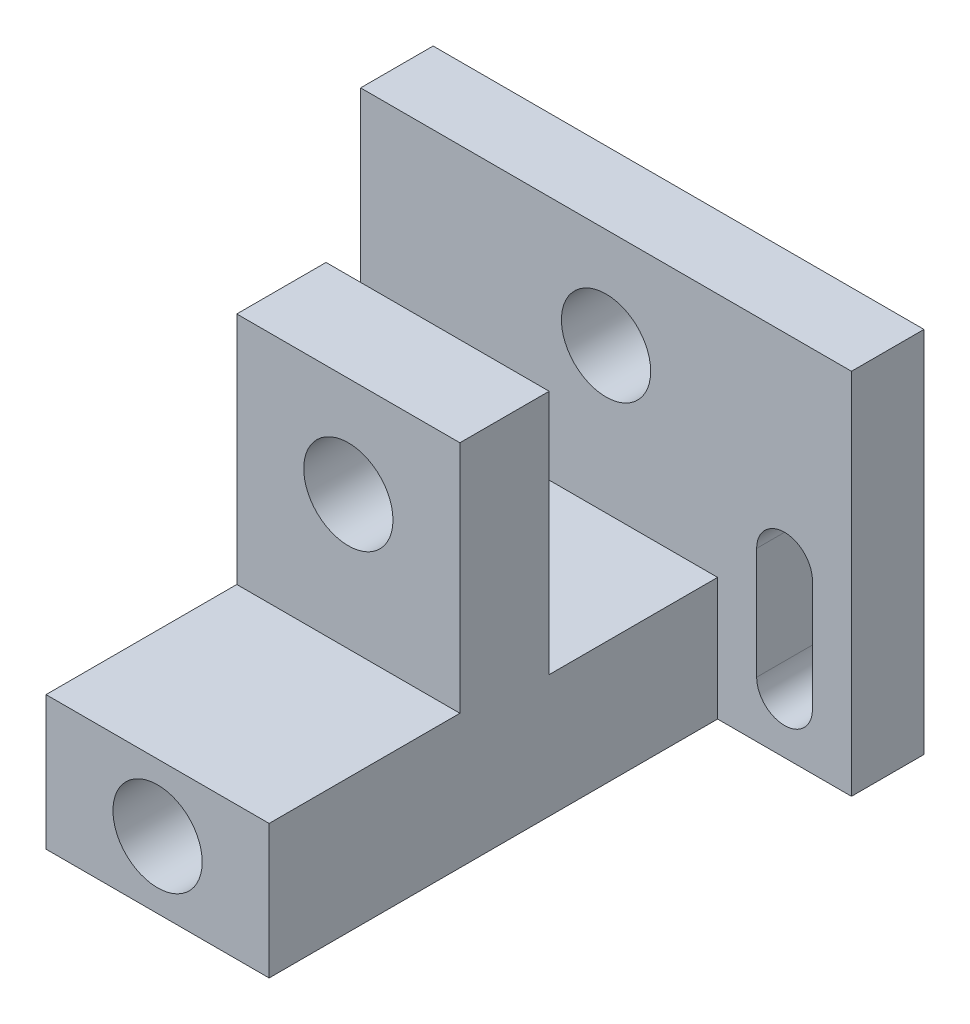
from build123d import *

# Parameters (mm, degrees)
LINEAR_AUSTRAGEN1_DEPTH            = 20
SKIZZE2_W                          = 12
SKIZZE2_H                          = 6.5
LINEAR_AUSTRAGEN2_DEPTH            = 33
F_8_0_8_DURCHMESSER_BOHRUNG1_D     = 8
SCHNITT_LINEAR_AUSTRAGEN1_REACH    = 63.066
M8X1_0_GEWINDEBOHRUNG1_D           = 7
M8X1_0_GEWINDEBOHRUNG1_DEPTH       = 28
M8X1_0_GEWINDEBOHRUNG1_CBORE_D     = 8
M8X1_0_GEWINDEBOHRUNG1_CBORE_DEPTH = 26
M8X1_0_GEWINDEBOHRUNG1_TIP         = 2.103012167


with BuildPart() as part:
    # Skizze1 → Linear austragen1 (new body)
    with BuildSketch(Plane(origin=(0, 0, 0), x_dir=(0, 0, -1), z_dir=(1, 0, 0))):
        Polygon((-23.35, 0), (23.35, 0), (23.35, 33), (16.85, 33), (16.85, 11), (1.75, 11), (1.75, 33), (-6.25, 33), (-6.25, 12), (-23.35, 12), align=None)
    extrude(amount=LINEAR_AUSTRAGEN1_DEPTH)

    # Skizze2 → Linear austragen2 (add)
    with BuildSketch(Plane(origin=(0, 33, 0), x_dir=(1, 0, 0), z_dir=(0, 1, 0))):
        with Locations((26, 20.1)):
            Rectangle(SKIZZE2_W, SKIZZE2_H)
        with Locations((-6, 20.1)):
            Rectangle(SKIZZE2_W, SKIZZE2_H)
    extrude(amount=-LINEAR_AUSTRAGEN2_DEPTH)

    # 8.0 _8_ Durchmesser Bohrung1 (through all)
    with Locations(Plane.XY.offset(6.25)):
        with Locations((10, 24)):
            Hole(F_8_0_8_DURCHMESSER_BOHRUNG1_D / 2)

    # Skizze6 → Schnitt-Linear austragen1 (cut, up to next)
    with BuildSketch(Plane.XY.offset(-16.85), mode=Mode.PRIVATE) as schnitt_linear_austragen1_sk1:
        with BuildLine():
            Line((23.5, 5), (23.5, 15))
            ThreePointArc((23.5, 15), (26, 17.5), (28.5, 15))
            Line((28.5, 15), (28.5, 5))
            ThreePointArc((28.5, 5), (26, 2.5), (23.5, 5))
        make_face()
    schnitt_linear_austragen1_tool1 = extrude(schnitt_linear_austragen1_sk1.sketch, amount=-SCHNITT_LINEAR_AUSTRAGEN1_REACH, mode=Mode.PRIVATE) & part.part
    # Skizze6 → Schnitt-Linear austragen1 (cut, up to next)
    with BuildSketch(Plane.XY.offset(-16.85), mode=Mode.PRIVATE) as schnitt_linear_austragen1_sk2:
        with BuildLine():
            Line((-8.5, 5), (-8.5, 15))
            ThreePointArc((-8.5, 15), (-6, 17.5), (-3.5, 15))
            Line((-3.5, 15), (-3.5, 5))
            ThreePointArc((-3.5, 5), (-6, 2.5), (-8.5, 5))
        make_face()
    schnitt_linear_austragen1_tool2 = extrude(schnitt_linear_austragen1_sk2.sketch, amount=-SCHNITT_LINEAR_AUSTRAGEN1_REACH, mode=Mode.PRIVATE) & part.part
    add(schnitt_linear_austragen1_tool1.solids().sort_by_distance((26, 10, -16.85))[0], mode=Mode.SUBTRACT)
    add(schnitt_linear_austragen1_tool2.solids().sort_by_distance((-6, 10, -16.85))[0], mode=Mode.SUBTRACT)

    # M8x1.0 Gewindebohrung1
    with Locations(Plane.XY.offset(23.35)):
        with Locations((10, 6)):
            CounterBoreHole(M8X1_0_GEWINDEBOHRUNG1_D / 2, M8X1_0_GEWINDEBOHRUNG1_CBORE_D / 2, M8X1_0_GEWINDEBOHRUNG1_CBORE_DEPTH, depth=M8X1_0_GEWINDEBOHRUNG1_DEPTH)
            with Locations((0, 0, -(M8X1_0_GEWINDEBOHRUNG1_DEPTH + M8X1_0_GEWINDEBOHRUNG1_TIP / 2))):  # 118° drill point
                Cone(0, M8X1_0_GEWINDEBOHRUNG1_D / 2, M8X1_0_GEWINDEBOHRUNG1_TIP, mode=Mode.SUBTRACT)


solid = part.part
